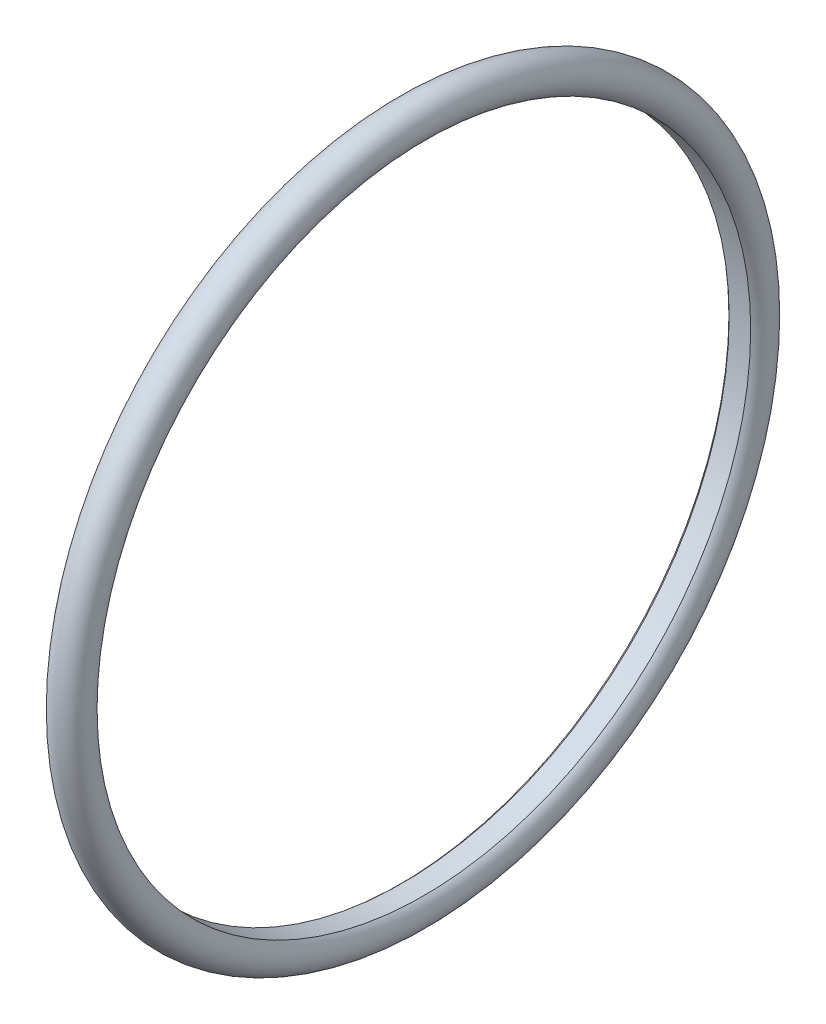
ISO-10303-21;
HEADER;
FILE_DESCRIPTION(('STEP AP214'),'2;1');
FILE_NAME('part.step','',(''),(''),'','','');
FILE_SCHEMA(('AUTOMOTIVE_DESIGN { 1 0 10303 214 1 1 1 1 }'));
ENDSEC;
DATA;
#1=APPLICATION_CONTEXT('core data for automotive mechanical design processes');
#2=APPLICATION_PROTOCOL_DEFINITION('international standard','automotive_design',2000,#1);
#3=PRODUCT_CONTEXT('',#1,'mechanical');
#4=PRODUCT('Part','Part','',(#3));
#5=PRODUCT_RELATED_PRODUCT_CATEGORY('part','',(#4));
#6=PRODUCT_DEFINITION_FORMATION('','',#4);
#7=PRODUCT_DEFINITION_CONTEXT('part definition',#1,'design');
#8=PRODUCT_DEFINITION('design','',#6,#7);
#9=PRODUCT_DEFINITION_SHAPE('','',#8);
#10=(LENGTH_UNIT() NAMED_UNIT(*) SI_UNIT(.MILLI.,.METRE.));
#11=(NAMED_UNIT(*) PLANE_ANGLE_UNIT() SI_UNIT($,.RADIAN.));
#12=(NAMED_UNIT(*) SI_UNIT($,.STERADIAN.) SOLID_ANGLE_UNIT());
#13=UNCERTAINTY_MEASURE_WITH_UNIT(LENGTH_MEASURE(1.E-05),#10,'distance_accuracy_value','');
#14=(GEOMETRIC_REPRESENTATION_CONTEXT(3) GLOBAL_UNCERTAINTY_ASSIGNED_CONTEXT((#13)) GLOBAL_UNIT_ASSIGNED_CONTEXT((#10,
#11,#12)) REPRESENTATION_CONTEXT('',''));
#15=CARTESIAN_POINT('',(0.,0.,0.));
#16=DIRECTION('',(0.,0.,1.));
#17=DIRECTION('',(1.,0.,0.));
#18=AXIS2_PLACEMENT_3D('',#15,#16,#17);
#19=CARTESIAN_POINT('',(0.,0.,0.));
#20=DIRECTION('',(-1.,0.,0.));
#21=DIRECTION('',(0.,0.,1.));
#22=AXIS2_PLACEMENT_3D('',#19,#20,#21);
#23=TOROIDAL_SURFACE('',#22,9.5,0.5);
#24=CARTESIAN_POINT('',(-0.299999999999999,0.,0.));
#25=DIRECTION('',(1.,0.,0.));
#26=DIRECTION('',(0.,0.,-1.));
#27=AXIS2_PLACEMENT_3D('',#24,#25,#26);
#28=CIRCLE('',#27,9.1);
#29=CARTESIAN_POINT('',(-0.299999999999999,0.,-9.1));
#30=VERTEX_POINT('',#29);
#31=EDGE_CURVE('E10',#30,#30,#28,.T.);
#32=ORIENTED_EDGE('',*,*,#31,.T.);
#33=EDGE_LOOP('',(#32));
#34=FACE_BOUND('',#33,.T.);
#35=CARTESIAN_POINT('',(0.299999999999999,0.,0.));
#36=DIRECTION('',(-1.,0.,0.));
#37=DIRECTION('',(0.,0.,1.));
#38=AXIS2_PLACEMENT_3D('',#35,#36,#37);
#39=CIRCLE('',#38,9.1);
#40=CARTESIAN_POINT('',(0.299999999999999,0.,9.1));
#41=VERTEX_POINT('',#40);
#42=EDGE_CURVE('E35',#41,#41,#39,.T.);
#43=ORIENTED_EDGE('',*,*,#42,.T.);
#44=EDGE_LOOP('',(#43));
#45=FACE_BOUND('',#44,.T.);
#46=ADVANCED_FACE('F29',(#34,#45),#23,.T.);
#47=CARTESIAN_POINT('',(-0.5,0.,0.));
#48=DIRECTION('',(1.,0.,0.));
#49=DIRECTION('',(0.,0.,-1.));
#50=AXIS2_PLACEMENT_3D('',#47,#48,#49);
#51=CYLINDRICAL_SURFACE('',#50,9.1);
#52=ORIENTED_EDGE('',*,*,#42,.F.);
#53=EDGE_LOOP('',(#52));
#54=FACE_BOUND('',#53,.T.);
#55=ORIENTED_EDGE('',*,*,#31,.F.);
#56=EDGE_LOOP('',(#55));
#57=FACE_BOUND('',#56,.T.);
#58=ADVANCED_FACE('F42',(#54,#57),#51,.F.);
#59=CLOSED_SHELL('',(#46,#58));
#60=MANIFOLD_SOLID_BREP('B2',#59);
#61=ADVANCED_BREP_SHAPE_REPRESENTATION('',(#18,#60),#14);
#62=SHAPE_DEFINITION_REPRESENTATION(#9,#61);
ENDSEC;
END-ISO-10303-21;
